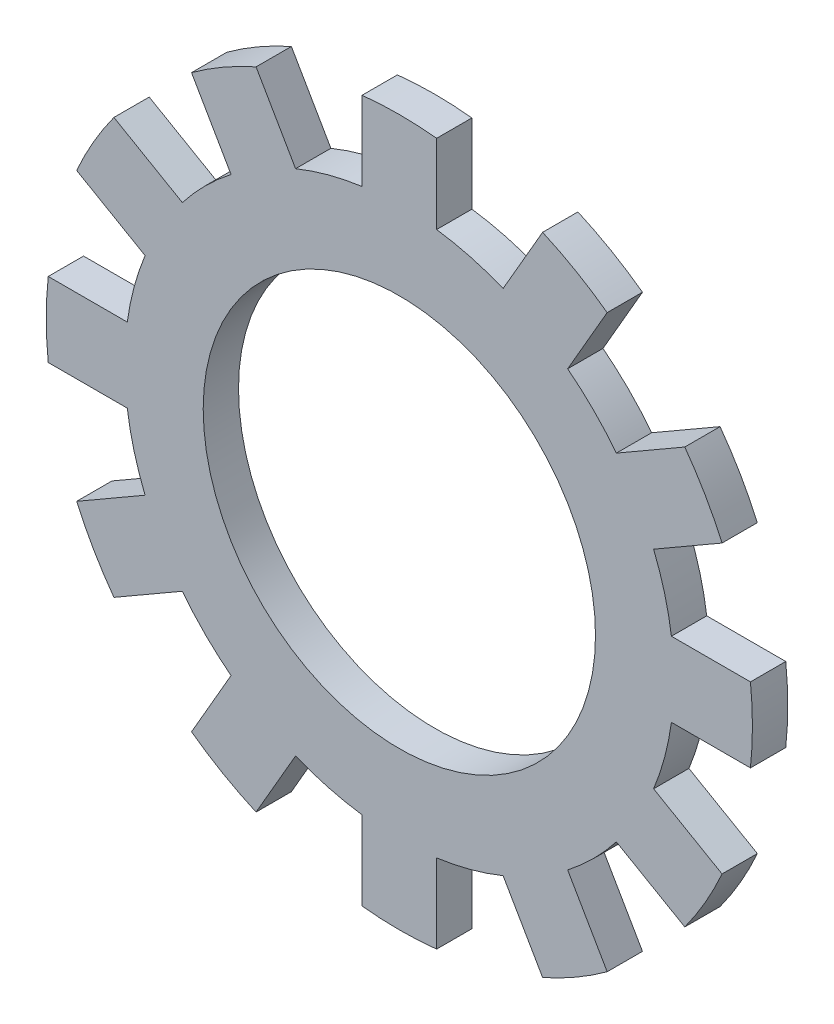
from build123d import *

# Parameters (mm, degrees)
SKETCH1_R                 = 7
SKETCH1_R_2               = 5
BOSS_EXTRUDE1_DEPTH       = 0.45
BOSS_EXTRUDE2_DEPTH       = 0.45
CIRPATTERN2_COUNT         = 12
CIRPATTERN2_COPY_1_DEPTH  = 0.45
CIRPATTERN2_COPY_2_DEPTH  = 0.45
CIRPATTERN2_COPY_3_DEPTH  = 0.45
CIRPATTERN2_COPY_4_DEPTH  = 0.45
CIRPATTERN2_COPY_5_DEPTH  = 0.45
CIRPATTERN2_COPY_6_DEPTH  = 0.45
CIRPATTERN2_COPY_7_DEPTH  = 0.45
CIRPATTERN2_COPY_8_DEPTH  = 0.45
CIRPATTERN2_COPY_9_DEPTH  = 0.45
CIRPATTERN2_COPY_10_DEPTH = 0.45
CIRPATTERN2_COPY_11_DEPTH = 0.45


with BuildPart() as part:
    # Sketch1 → Boss-Extrude1 (new, symmetric)
    with BuildSketch(Plane.XY):
        Circle(SKETCH1_R)
        Circle(SKETCH1_R_2, mode=Mode.SUBTRACT)
    extrude(amount=BOSS_EXTRUDE1_DEPTH, both=True)

    # Sketch3 → Boss-Extrude2 (add, symmetric)
    with BuildSketch(Plane.XY):
        with BuildLine():
            Line((-0.95, 8.949720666), (-0.95, 6.935236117))
            ThreePointArc((-0.95, 6.935236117), (-0.4761025, 6.983790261), (0, 7))
            Line((0, 7), (0, 9))
            ThreePointArc((0, 9), (-0.475664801, 8.987421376), (-0.95, 8.949720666))
        make_face()
    boss_extrude2 = extrude(amount=BOSS_EXTRUDE2_DEPTH, both=True)

    # Mirror1: Boss-Extrude2 across plane
    add(boss_extrude2.mirror(Plane(origin=(0, 0, 0), x_dir=(0, 0, 1), z_dir=(1, 0, 0))))

    # CirPattern2: Boss-Extrude2 ×12 about axis
    cirpattern2_axis = Axis((0, 0, 0), (0, 0, 1))
    for i in range(1, CIRPATTERN2_COUNT):
        add(boss_extrude2.rotate(cirpattern2_axis, i * 360 / CIRPATTERN2_COUNT))

    # CirPattern2 copy 1 sketch → CirPattern2 copy 1 (add, symmetric)
    with BuildSketch(Plane(origin=(0, 0, 0), x_dir=(-0.8660254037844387, -0.49999999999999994, 0), z_dir=(0, 0, 1))):
        with BuildLine():
            Line((-0.95, -8.949720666), (-0.95, -6.935236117))
            ThreePointArc((-0.95, -6.935236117), (-0.4761025, -6.983790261), (0, -7))
            Line((0, -7), (0, -9))
            ThreePointArc((0, -9), (-0.475664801, -8.987421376), (-0.95, -8.949720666))
        make_face()
    extrude(amount=CIRPATTERN2_COPY_1_DEPTH, both=True)

    # CirPattern2 copy 2 sketch → CirPattern2 copy 2 (add, symmetric)
    with BuildSketch(Plane(origin=(0, 0, 0), x_dir=(-0.5000000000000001, -0.8660254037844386, 0), z_dir=(0, 0, 1))):
        with BuildLine():
            Line((-0.95, -8.949720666), (-0.95, -6.935236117))
            ThreePointArc((-0.95, -6.935236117), (-0.4761025, -6.983790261), (0, -7))
            Line((0, -7), (0, -9))
            ThreePointArc((0, -9), (-0.475664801, -8.987421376), (-0.95, -8.949720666))
        make_face()
    extrude(amount=CIRPATTERN2_COPY_2_DEPTH, both=True)

    # CirPattern2 copy 3 sketch → CirPattern2 copy 3 (add, symmetric)
    with BuildSketch(Plane(origin=(0, 0, 0), x_dir=(0, -1, 0), z_dir=(0, 0, 1))):
        with BuildLine():
            Line((-0.95, -8.949720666), (-0.95, -6.935236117))
            ThreePointArc((-0.95, -6.935236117), (-0.4761025, -6.983790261), (0, -7))
            Line((0, -7), (0, -9))
            ThreePointArc((0, -9), (-0.475664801, -8.987421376), (-0.95, -8.949720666))
        make_face()
    extrude(amount=CIRPATTERN2_COPY_3_DEPTH, both=True)

    # CirPattern2 copy 4 sketch → CirPattern2 copy 4 (add, symmetric)
    with BuildSketch(Plane(origin=(0, 0, 0), x_dir=(0.4999999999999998, -0.8660254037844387, 0), z_dir=(0, 0, 1))):
        with BuildLine():
            Line((-0.95, -8.949720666), (-0.95, -6.935236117))
            ThreePointArc((-0.95, -6.935236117), (-0.4761025, -6.983790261), (0, -7))
            Line((0, -7), (0, -9))
            ThreePointArc((0, -9), (-0.475664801, -8.987421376), (-0.95, -8.949720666))
        make_face()
    extrude(amount=CIRPATTERN2_COPY_4_DEPTH, both=True)

    # CirPattern2 copy 5 sketch → CirPattern2 copy 5 (add, symmetric)
    with BuildSketch(Plane(origin=(0, 0, 0), x_dir=(0.8660254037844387, -0.49999999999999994, 0), z_dir=(0, 0, 1))):
        with BuildLine():
            Line((-0.95, -8.949720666), (-0.95, -6.935236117))
            ThreePointArc((-0.95, -6.935236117), (-0.4761025, -6.983790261), (0, -7))
            Line((0, -7), (0, -9))
            ThreePointArc((0, -9), (-0.475664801, -8.987421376), (-0.95, -8.949720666))
        make_face()
    extrude(amount=CIRPATTERN2_COPY_5_DEPTH, both=True)

    # CirPattern2 copy 6 sketch → CirPattern2 copy 6 (add, symmetric)
    with BuildSketch(Plane.XY):
        with BuildLine():
            Line((-0.95, -8.949720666), (-0.95, -6.935236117))
            ThreePointArc((-0.95, -6.935236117), (-0.4761025, -6.983790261), (0, -7))
            Line((0, -7), (0, -9))
            ThreePointArc((0, -9), (-0.475664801, -8.987421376), (-0.95, -8.949720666))
        make_face()
    extrude(amount=CIRPATTERN2_COPY_6_DEPTH, both=True)

    # CirPattern2 copy 7 sketch → CirPattern2 copy 7 (add, symmetric)
    with BuildSketch(Plane(origin=(0, 0, 0), x_dir=(0.8660254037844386, 0.5000000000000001, 0), z_dir=(0, 0, 1))):
        with BuildLine():
            Line((-0.95, -8.949720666), (-0.95, -6.935236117))
            ThreePointArc((-0.95, -6.935236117), (-0.4761025, -6.983790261), (0, -7))
            Line((0, -7), (0, -9))
            ThreePointArc((0, -9), (-0.475664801, -8.987421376), (-0.95, -8.949720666))
        make_face()
    extrude(amount=CIRPATTERN2_COPY_7_DEPTH, both=True)

    # CirPattern2 copy 8 sketch → CirPattern2 copy 8 (add, symmetric)
    with BuildSketch(Plane(origin=(0, 0, 0), x_dir=(0.5000000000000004, 0.8660254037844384, 0), z_dir=(0, 0, 1))):
        with BuildLine():
            Line((-0.95, -8.949720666), (-0.95, -6.935236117))
            ThreePointArc((-0.95, -6.935236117), (-0.4761025, -6.983790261), (0, -7))
            Line((0, -7), (0, -9))
            ThreePointArc((0, -9), (-0.475664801, -8.987421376), (-0.95, -8.949720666))
        make_face()
    extrude(amount=CIRPATTERN2_COPY_8_DEPTH, both=True)

    # CirPattern2 copy 9 sketch → CirPattern2 copy 9 (add, symmetric)
    with BuildSketch(Plane(origin=(0, 0, 0), x_dir=(0, 1, 0), z_dir=(0, 0, 1))):
        with BuildLine():
            Line((-0.95, -8.949720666), (-0.95, -6.935236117))
            ThreePointArc((-0.95, -6.935236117), (-0.4761025, -6.983790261), (0, -7))
            Line((0, -7), (0, -9))
            ThreePointArc((0, -9), (-0.475664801, -8.987421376), (-0.95, -8.949720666))
        make_face()
    extrude(amount=CIRPATTERN2_COPY_9_DEPTH, both=True)

    # CirPattern2 copy 10 sketch → CirPattern2 copy 10 (add, symmetric)
    with BuildSketch(Plane(origin=(0, 0, 0), x_dir=(-0.5000000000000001, 0.8660254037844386, 0), z_dir=(0, 0, 1))):
        with BuildLine():
            Line((-0.95, -8.949720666), (-0.95, -6.935236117))
            ThreePointArc((-0.95, -6.935236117), (-0.4761025, -6.983790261), (0, -7))
            Line((0, -7), (0, -9))
            ThreePointArc((0, -9), (-0.475664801, -8.987421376), (-0.95, -8.949720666))
        make_face()
    extrude(amount=CIRPATTERN2_COPY_10_DEPTH, both=True)

    # CirPattern2 copy 11 sketch → CirPattern2 copy 11 (add, symmetric)
    with BuildSketch(Plane(origin=(0, 0, 0), x_dir=(-0.8660254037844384, 0.5000000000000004, 0), z_dir=(0, 0, 1))):
        with BuildLine():
            Line((-0.95, -8.949720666), (-0.95, -6.935236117))
            ThreePointArc((-0.95, -6.935236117), (-0.4761025, -6.983790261), (0, -7))
            Line((0, -7), (0, -9))
            ThreePointArc((0, -9), (-0.475664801, -8.987421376), (-0.95, -8.949720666))
        make_face()
    extrude(amount=CIRPATTERN2_COPY_11_DEPTH, both=True)


solid = part.part
